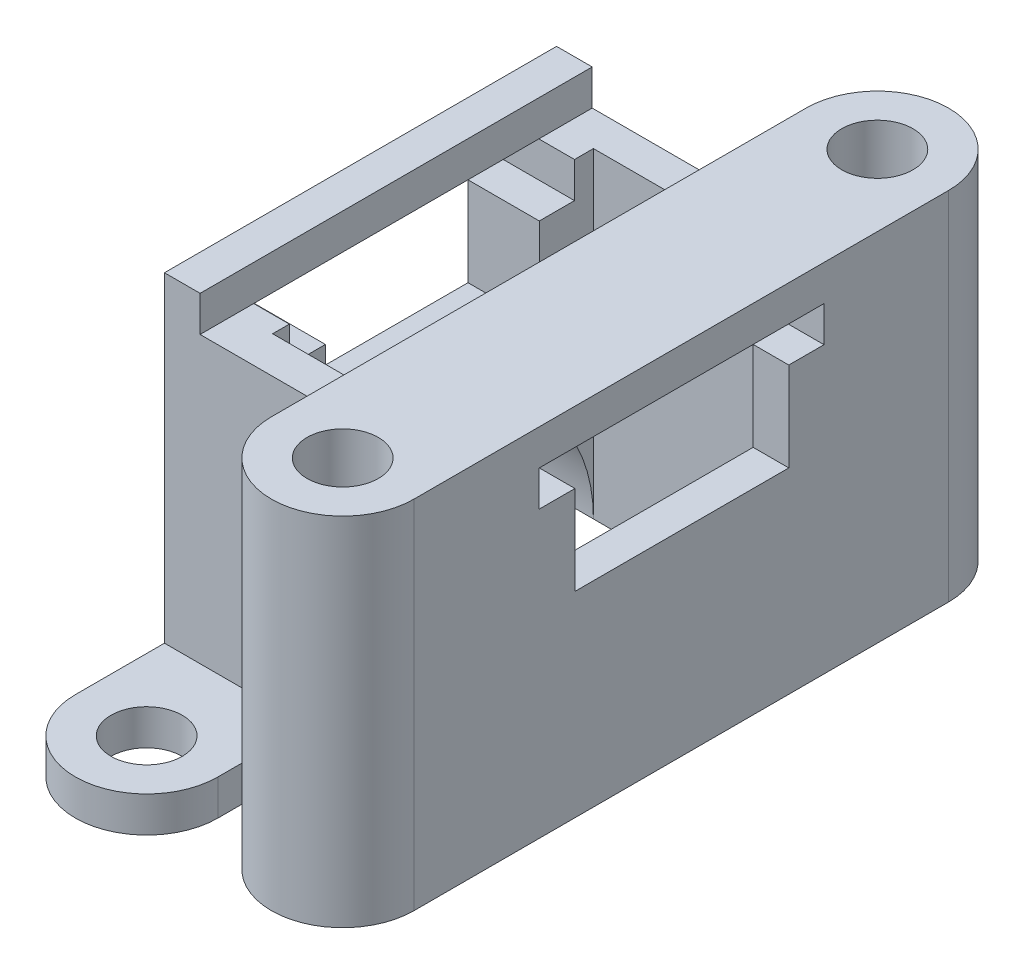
ISO-10303-21;
HEADER;
FILE_DESCRIPTION(('STEP AP214'),'2;1');
FILE_NAME('part.step','',(''),(''),'','','');
FILE_SCHEMA(('AUTOMOTIVE_DESIGN { 1 0 10303 214 1 1 1 1 }'));
ENDSEC;
DATA;
#1=APPLICATION_CONTEXT('core data for automotive mechanical design processes');
#2=APPLICATION_PROTOCOL_DEFINITION('international standard','automotive_design',2000,#1);
#3=PRODUCT_CONTEXT('',#1,'mechanical');
#4=PRODUCT('Part','Part','',(#3));
#5=PRODUCT_RELATED_PRODUCT_CATEGORY('part','',(#4));
#6=PRODUCT_DEFINITION_FORMATION('','',#4);
#7=PRODUCT_DEFINITION_CONTEXT('part definition',#1,'design');
#8=PRODUCT_DEFINITION('design','',#6,#7);
#9=PRODUCT_DEFINITION_SHAPE('','',#8);
#10=(LENGTH_UNIT() NAMED_UNIT(*) SI_UNIT(.MILLI.,.METRE.));
#11=(NAMED_UNIT(*) PLANE_ANGLE_UNIT() SI_UNIT($,.RADIAN.));
#12=(NAMED_UNIT(*) SI_UNIT($,.STERADIAN.) SOLID_ANGLE_UNIT());
#13=UNCERTAINTY_MEASURE_WITH_UNIT(LENGTH_MEASURE(1.E-05),#10,'distance_accuracy_value','');
#14=(GEOMETRIC_REPRESENTATION_CONTEXT(3) GLOBAL_UNCERTAINTY_ASSIGNED_CONTEXT((#13)) GLOBAL_UNIT_ASSIGNED_CONTEXT((#10,
#11,#12)) REPRESENTATION_CONTEXT('',''));
#15=CARTESIAN_POINT('',(0.,0.,0.));
#16=DIRECTION('',(0.,0.,1.));
#17=DIRECTION('',(1.,0.,0.));
#18=AXIS2_PLACEMENT_3D('',#15,#16,#17);
#19=CARTESIAN_POINT('',(20.8041237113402,17.,1.01982154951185));
#20=DIRECTION('',(0.,0.,1.));
#21=DIRECTION('',(1.,0.,0.));
#22=AXIS2_PLACEMENT_3D('',#19,#20,#21);
#23=PLANE('',#22);
#24=DIRECTION('',(0.,1.,0.));
#25=VECTOR('',#24,1.);
#26=CARTESIAN_POINT('',(20.8041237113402,17.,1.01982154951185));
#27=LINE('',#26,#25);
#28=CARTESIAN_POINT('',(20.8041237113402,17.,1.01982154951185));
#29=VERTEX_POINT('',#28);
#30=CARTESIAN_POINT('',(20.8041237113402,16.,1.01982154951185));
#31=VERTEX_POINT('',#30);
#32=EDGE_CURVE('E344',#29,#31,#27,.F.);
#33=ORIENTED_EDGE('',*,*,#32,.F.);
#34=DIRECTION('',(1.,0.,0.));
#35=VECTOR('',#34,1.);
#36=CARTESIAN_POINT('',(20.8041237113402,17.,1.01982154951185));
#37=LINE('',#36,#35);
#38=CARTESIAN_POINT('',(21.8041237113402,17.,1.01982154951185));
#39=VERTEX_POINT('',#38);
#40=EDGE_CURVE('E383',#39,#29,#37,.F.);
#41=ORIENTED_EDGE('',*,*,#40,.F.);
#42=DIRECTION('',(1.,0.,0.));
#43=VECTOR('',#42,1.);
#44=CARTESIAN_POINT('',(20.8041237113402,17.,1.01982154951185));
#45=LINE('',#44,#43);
#46=CARTESIAN_POINT('',(22.8041237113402,17.,1.01982154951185));
#47=VERTEX_POINT('',#46);
#48=EDGE_CURVE('E380',#47,#39,#45,.F.);
#49=ORIENTED_EDGE('',*,*,#48,.F.);
#50=DIRECTION('',(0.,1.,0.));
#51=VECTOR('',#50,1.);
#52=CARTESIAN_POINT('',(22.8041237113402,17.,1.01982154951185));
#53=LINE('',#52,#51);
#54=CARTESIAN_POINT('',(22.8041237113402,16.,1.01982154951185));
#55=VERTEX_POINT('',#54);
#56=EDGE_CURVE('E384',#55,#47,#53,.T.);
#57=ORIENTED_EDGE('',*,*,#56,.F.);
#58=DIRECTION('',(1.,0.,0.));
#59=VECTOR('',#58,1.);
#60=CARTESIAN_POINT('',(20.8041237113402,16.,1.01982154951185));
#61=LINE('',#60,#59);
#62=EDGE_CURVE('E332',#55,#31,#61,.F.);
#63=ORIENTED_EDGE('',*,*,#62,.T.);
#64=EDGE_LOOP('',(#33,#41,#49,#57,#63));
#65=FACE_BOUND('',#64,.T.);
#66=ADVANCED_FACE('F17',(#65),#23,.F.);
#67=CARTESIAN_POINT('',(20.8041237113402,17.,-6.98017845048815));
#68=DIRECTION('',(0.,0.,-1.));
#69=DIRECTION('',(-1.,0.,0.));
#70=AXIS2_PLACEMENT_3D('',#67,#68,#69);
#71=PLANE('',#70);
#72=DIRECTION('',(0.,1.,0.));
#73=VECTOR('',#72,1.);
#74=CARTESIAN_POINT('',(20.8041237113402,17.,-6.98017845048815));
#75=LINE('',#74,#73);
#76=CARTESIAN_POINT('',(20.8041237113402,16.,-6.98017845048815));
#77=VERTEX_POINT('',#76);
#78=CARTESIAN_POINT('',(20.8041237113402,17.,-6.98017845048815));
#79=VERTEX_POINT('',#78);
#80=EDGE_CURVE('E350',#77,#79,#75,.T.);
#81=ORIENTED_EDGE('',*,*,#80,.F.);
#82=DIRECTION('',(1.,0.,0.));
#83=VECTOR('',#82,1.);
#84=CARTESIAN_POINT('',(20.8041237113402,16.,-6.98017845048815));
#85=LINE('',#84,#83);
#86=CARTESIAN_POINT('',(22.8041237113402,16.,-6.98017845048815));
#87=VERTEX_POINT('',#86);
#88=EDGE_CURVE('E323',#77,#87,#85,.T.);
#89=ORIENTED_EDGE('',*,*,#88,.T.);
#90=DIRECTION('',(0.,1.,0.));
#91=VECTOR('',#90,1.);
#92=CARTESIAN_POINT('',(22.8041237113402,17.,-6.98017845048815));
#93=LINE('',#92,#91);
#94=CARTESIAN_POINT('',(22.8041237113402,17.,-6.98017845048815));
#95=VERTEX_POINT('',#94);
#96=EDGE_CURVE('E343',#95,#87,#93,.F.);
#97=ORIENTED_EDGE('',*,*,#96,.F.);
#98=DIRECTION('',(-1.,0.,0.));
#99=VECTOR('',#98,1.);
#100=CARTESIAN_POINT('',(20.8041237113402,17.,-6.98017845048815));
#101=LINE('',#100,#99);
#102=CARTESIAN_POINT('',(21.8041237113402,17.,-6.98017845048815));
#103=VERTEX_POINT('',#102);
#104=EDGE_CURVE('E340',#103,#95,#101,.F.);
#105=ORIENTED_EDGE('',*,*,#104,.F.);
#106=DIRECTION('',(-1.,0.,0.));
#107=VECTOR('',#106,1.);
#108=CARTESIAN_POINT('',(20.8041237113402,17.,-6.98017845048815));
#109=LINE('',#108,#107);
#110=EDGE_CURVE('E347',#79,#103,#109,.F.);
#111=ORIENTED_EDGE('',*,*,#110,.F.);
#112=EDGE_LOOP('',(#81,#89,#97,#105,#111));
#113=FACE_BOUND('',#112,.T.);
#114=ADVANCED_FACE('F933',(#113),#71,.F.);
#115=CARTESIAN_POINT('',(20.8041237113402,16.,1.01982154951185));
#116=DIRECTION('',(0.,-1.,0.));
#117=DIRECTION('',(0.,0.,-1.));
#118=AXIS2_PLACEMENT_3D('',#115,#116,#117);
#119=PLANE('',#118);
#120=DIRECTION('',(0.,0.,-1.));
#121=VECTOR('',#120,1.);
#122=CARTESIAN_POINT('',(20.8041237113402,16.,1.01982154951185));
#123=LINE('',#122,#121);
#124=CARTESIAN_POINT('',(20.8041237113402,16.,0.00780346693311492));
#125=VERTEX_POINT('',#124);
#126=EDGE_CURVE('E329',#31,#125,#123,.T.);
#127=ORIENTED_EDGE('',*,*,#126,.F.);
#128=ORIENTED_EDGE('',*,*,#62,.F.);
#129=DIRECTION('',(0.,0.,1.));
#130=VECTOR('',#129,1.);
#131=CARTESIAN_POINT('',(22.8041237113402,16.,1.48891790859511));
#132=LINE('',#131,#130);
#133=CARTESIAN_POINT('',(22.8041237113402,16.,0.00780346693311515));
#134=VERTEX_POINT('',#133);
#135=EDGE_CURVE('E402',#55,#134,#132,.F.);
#136=ORIENTED_EDGE('',*,*,#135,.T.);
#137=DIRECTION('',(1.,0.,0.));
#138=VECTOR('',#137,1.);
#139=CARTESIAN_POINT('',(20.8041237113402,16.,0.00780346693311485));
#140=LINE('',#139,#138);
#141=EDGE_CURVE('E531',#134,#125,#140,.F.);
#142=ORIENTED_EDGE('',*,*,#141,.T.);
#143=EDGE_LOOP('',(#127,#128,#136,#142));
#144=FACE_BOUND('',#143,.T.);
#145=ADVANCED_FACE('F930',(#144),#119,.F.);
#146=CARTESIAN_POINT('',(20.8041237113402,16.,-5.99219653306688));
#147=DIRECTION('',(0.,-1.,0.));
#148=DIRECTION('',(0.,0.,-1.));
#149=AXIS2_PLACEMENT_3D('',#146,#147,#148);
#150=PLANE('',#149);
#151=DIRECTION('',(0.,0.,-1.));
#152=VECTOR('',#151,1.);
#153=CARTESIAN_POINT('',(20.8041237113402,16.,-5.99219653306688));
#154=LINE('',#153,#152);
#155=CARTESIAN_POINT('',(20.8041237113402,16.,-5.99219653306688));
#156=VERTEX_POINT('',#155);
#157=EDGE_CURVE('E331',#156,#77,#154,.T.);
#158=ORIENTED_EDGE('',*,*,#157,.F.);
#159=DIRECTION('',(-1.,0.,0.));
#160=VECTOR('',#159,1.);
#161=CARTESIAN_POINT('',(20.8041237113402,16.,-5.99219653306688));
#162=LINE('',#161,#160);
#163=CARTESIAN_POINT('',(22.8041237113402,16.,-5.99219653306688));
#164=VERTEX_POINT('',#163);
#165=EDGE_CURVE('E337',#156,#164,#162,.F.);
#166=ORIENTED_EDGE('',*,*,#165,.T.);
#167=DIRECTION('',(0.,0.,1.));
#168=VECTOR('',#167,1.);
#169=CARTESIAN_POINT('',(22.8041237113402,16.,1.48891790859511));
#170=LINE('',#169,#168);
#171=EDGE_CURVE('E316',#164,#87,#170,.F.);
#172=ORIENTED_EDGE('',*,*,#171,.T.);
#173=ORIENTED_EDGE('',*,*,#88,.F.);
#174=EDGE_LOOP('',(#158,#166,#172,#173));
#175=FACE_BOUND('',#174,.T.);
#176=ADVANCED_FACE('F927',(#175),#150,.F.);
#177=CARTESIAN_POINT('',(21.8041237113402,17.,2.5232552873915));
#178=DIRECTION('',(-1.,0.,0.));
#179=DIRECTION('',(0.,0.,1.));
#180=AXIS2_PLACEMENT_3D('',#177,#178,#179);
#181=PLANE('',#180);
#182=DIRECTION('',(0.,1.,0.));
#183=VECTOR('',#182,1.);
#184=CARTESIAN_POINT('',(21.8041237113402,18.,2.5232552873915));
#185=LINE('',#184,#183);
#186=CARTESIAN_POINT('',(21.8041237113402,18.,2.5232552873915));
#187=VERTEX_POINT('',#186);
#188=CARTESIAN_POINT('',(21.8041237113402,17.,2.5232552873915));
#189=VERTEX_POINT('',#188);
#190=EDGE_CURVE('E283',#187,#189,#185,.F.);
#191=ORIENTED_EDGE('',*,*,#190,.T.);
#192=DIRECTION('',(0.,0.,-1.));
#193=VECTOR('',#192,1.);
#194=CARTESIAN_POINT('',(21.8041237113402,17.,0.));
#195=LINE('',#194,#193);
#196=EDGE_CURVE('E317',#189,#39,#195,.T.);
#197=ORIENTED_EDGE('',*,*,#196,.T.);
#198=DIRECTION('',(0.,0.,1.));
#199=VECTOR('',#198,1.);
#200=CARTESIAN_POINT('',(21.8041237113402,17.,0.));
#201=LINE('',#200,#199);
#202=EDGE_CURVE('E333',#39,#103,#201,.F.);
#203=ORIENTED_EDGE('',*,*,#202,.T.);
#204=DIRECTION('',(0.,0.,-1.));
#205=VECTOR('',#204,1.);
#206=CARTESIAN_POINT('',(21.8041237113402,17.,0.));
#207=LINE('',#206,#205);
#208=CARTESIAN_POINT('',(21.8041237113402,17.,-8.47674471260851));
#209=VERTEX_POINT('',#208);
#210=EDGE_CURVE('E314',#103,#209,#207,.T.);
#211=ORIENTED_EDGE('',*,*,#210,.T.);
#212=DIRECTION('',(0.,1.,0.));
#213=VECTOR('',#212,1.);
#214=CARTESIAN_POINT('',(21.8041237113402,17.,-8.47674471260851));
#215=LINE('',#214,#213);
#216=CARTESIAN_POINT('',(21.8041237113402,18.,-8.47674471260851));
#217=VERTEX_POINT('',#216);
#218=EDGE_CURVE('E305',#217,#209,#215,.F.);
#219=ORIENTED_EDGE('',*,*,#218,.F.);
#220=DIRECTION('',(0.,0.,-1.));
#221=VECTOR('',#220,1.);
#222=CARTESIAN_POINT('',(21.8041237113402,18.,4.52325528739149));
#223=LINE('',#222,#221);
#224=EDGE_CURVE('E298',#217,#187,#223,.F.);
#225=ORIENTED_EDGE('',*,*,#224,.T.);
#226=EDGE_LOOP('',(#191,#197,#203,#211,#219,#225));
#227=FACE_BOUND('',#226,.T.);
#228=ADVANCED_FACE('F303',(#227),#181,.F.);
#229=CARTESIAN_POINT('',(0.,17.,0.));
#230=DIRECTION('',(0.,-1.,0.));
#231=DIRECTION('',(0.,0.,-1.));
#232=AXIS2_PLACEMENT_3D('',#229,#230,#231);
#233=PLANE('',#232);
#234=ORIENTED_EDGE('',*,*,#48,.T.);
#235=ORIENTED_EDGE('',*,*,#196,.F.);
#236=DIRECTION('',(-1.,0.,0.));
#237=VECTOR('',#236,1.);
#238=CARTESIAN_POINT('',(25.8041237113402,17.,2.5232552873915));
#239=LINE('',#238,#237);
#240=CARTESIAN_POINT('',(25.8041237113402,17.,2.5232552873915));
#241=VERTEX_POINT('',#240);
#242=EDGE_CURVE('E289',#189,#241,#239,.F.);
#243=ORIENTED_EDGE('',*,*,#242,.T.);
#244=DIRECTION('',(0.,0.,-1.));
#245=VECTOR('',#244,1.);
#246=CARTESIAN_POINT('',(25.8041237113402,17.,-8.47674471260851));
#247=LINE('',#246,#245);
#248=CARTESIAN_POINT('',(25.8041237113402,17.,1.48891790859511));
#249=VERTEX_POINT('',#248);
#250=EDGE_CURVE('E467',#241,#249,#247,.T.);
#251=ORIENTED_EDGE('',*,*,#250,.T.);
#252=DIRECTION('',(1.,0.,0.));
#253=VECTOR('',#252,1.);
#254=CARTESIAN_POINT('',(28.8041237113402,17.,1.48891790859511));
#255=LINE('',#254,#253);
#256=CARTESIAN_POINT('',(22.8041237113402,17.,1.48891790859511));
#257=VERTEX_POINT('',#256);
#258=EDGE_CURVE('E460',#249,#257,#255,.F.);
#259=ORIENTED_EDGE('',*,*,#258,.T.);
#260=DIRECTION('',(0.,0.,1.));
#261=VECTOR('',#260,1.);
#262=CARTESIAN_POINT('',(22.8041237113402,17.,1.48891790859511));
#263=LINE('',#262,#261);
#264=EDGE_CURVE('E405',#257,#47,#263,.F.);
#265=ORIENTED_EDGE('',*,*,#264,.T.);
#266=EDGE_LOOP('',(#234,#235,#243,#251,#259,#265));
#267=FACE_BOUND('',#266,.T.);
#268=ADVANCED_FACE('F920',(#267),#233,.F.);
#269=CARTESIAN_POINT('',(0.,17.,0.));
#270=DIRECTION('',(0.,-1.,0.));
#271=DIRECTION('',(0.,0.,-1.));
#272=AXIS2_PLACEMENT_3D('',#269,#270,#271);
#273=PLANE('',#272);
#274=DIRECTION('',(1.,0.,0.));
#275=VECTOR('',#274,1.);
#276=CARTESIAN_POINT('',(24.8041237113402,17.,-8.47674471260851));
#277=LINE('',#276,#275);
#278=CARTESIAN_POINT('',(25.8041237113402,17.,-8.47674471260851));
#279=VERTEX_POINT('',#278);
#280=EDGE_CURVE('E481',#279,#209,#277,.F.);
#281=ORIENTED_EDGE('',*,*,#280,.T.);
#282=ORIENTED_EDGE('',*,*,#210,.F.);
#283=ORIENTED_EDGE('',*,*,#104,.T.);
#284=DIRECTION('',(0.,0.,1.));
#285=VECTOR('',#284,1.);
#286=CARTESIAN_POINT('',(22.8041237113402,17.,1.48891790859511));
#287=LINE('',#286,#285);
#288=CARTESIAN_POINT('',(22.8041237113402,17.,-7.51108209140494));
#289=VERTEX_POINT('',#288);
#290=EDGE_CURVE('E377',#95,#289,#287,.F.);
#291=ORIENTED_EDGE('',*,*,#290,.T.);
#292=DIRECTION('',(-1.,0.,0.));
#293=VECTOR('',#292,1.);
#294=CARTESIAN_POINT('',(28.8041237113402,17.,-7.51108209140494));
#295=LINE('',#294,#293);
#296=CARTESIAN_POINT('',(25.8041237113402,17.,-7.51108209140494));
#297=VERTEX_POINT('',#296);
#298=EDGE_CURVE('E540',#289,#297,#295,.F.);
#299=ORIENTED_EDGE('',*,*,#298,.T.);
#300=DIRECTION('',(0.,0.,-1.));
#301=VECTOR('',#300,1.);
#302=CARTESIAN_POINT('',(25.8041237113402,17.,-8.47674471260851));
#303=LINE('',#302,#301);
#304=EDGE_CURVE('E564',#297,#279,#303,.T.);
#305=ORIENTED_EDGE('',*,*,#304,.T.);
#306=EDGE_LOOP('',(#281,#282,#283,#291,#299,#305));
#307=FACE_BOUND('',#306,.T.);
#308=ADVANCED_FACE('F916',(#307),#273,.F.);
#309=CARTESIAN_POINT('',(22.8041237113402,17.,1.48891790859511));
#310=DIRECTION('',(-1.,0.,0.));
#311=DIRECTION('',(0.,0.,1.));
#312=AXIS2_PLACEMENT_3D('',#309,#310,#311);
#313=PLANE('',#312);
#314=ORIENTED_EDGE('',*,*,#56,.T.);
#315=ORIENTED_EDGE('',*,*,#264,.F.);
#316=DIRECTION('',(0.,1.,0.));
#317=VECTOR('',#316,1.);
#318=CARTESIAN_POINT('',(22.8041237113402,17.,1.48891790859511));
#319=LINE('',#318,#317);
#320=CARTESIAN_POINT('',(22.8041237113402,8.,1.48891790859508));
#321=VERTEX_POINT('',#320);
#322=EDGE_CURVE('E587',#257,#321,#319,.F.);
#323=ORIENTED_EDGE('',*,*,#322,.T.);
#324=CARTESIAN_POINT('',(22.8041237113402,8.,-3.01108209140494));
#325=DIRECTION('',(1.,0.,0.));
#326=DIRECTION('',(0.,0.,-1.));
#327=AXIS2_PLACEMENT_3D('',#324,#325,#326);
#328=CIRCLE('',#327,4.5);
#329=CARTESIAN_POINT('',(22.8041237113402,8.,-7.51108209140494));
#330=VERTEX_POINT('',#329);
#331=EDGE_CURVE('E453',#321,#330,#328,.F.);
#332=ORIENTED_EDGE('',*,*,#331,.T.);
#333=DIRECTION('',(0.,1.,0.));
#334=VECTOR('',#333,1.);
#335=CARTESIAN_POINT('',(22.8041237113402,17.,-7.51108209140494));
#336=LINE('',#335,#334);
#337=EDGE_CURVE('E457',#330,#289,#336,.T.);
#338=ORIENTED_EDGE('',*,*,#337,.T.);
#339=ORIENTED_EDGE('',*,*,#290,.F.);
#340=ORIENTED_EDGE('',*,*,#96,.T.);
#341=ORIENTED_EDGE('',*,*,#171,.F.);
#342=DIRECTION('',(0.,1.,0.));
#343=VECTOR('',#342,1.);
#344=CARTESIAN_POINT('',(22.8041237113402,16.,-5.99219653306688));
#345=LINE('',#344,#343);
#346=CARTESIAN_POINT('',(22.8041237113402,13.5,-5.99219653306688));
#347=VERTEX_POINT('',#346);
#348=EDGE_CURVE('E522',#164,#347,#345,.F.);
#349=ORIENTED_EDGE('',*,*,#348,.T.);
#350=DIRECTION('',(0.,0.,-1.));
#351=VECTOR('',#350,1.);
#352=CARTESIAN_POINT('',(22.8041237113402,13.5,0.00780346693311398));
#353=LINE('',#352,#351);
#354=CARTESIAN_POINT('',(22.8041237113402,13.5,0.00780346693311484));
#355=VERTEX_POINT('',#354);
#356=EDGE_CURVE('E528',#347,#355,#353,.F.);
#357=ORIENTED_EDGE('',*,*,#356,.T.);
#358=DIRECTION('',(0.,-1.,0.));
#359=VECTOR('',#358,1.);
#360=CARTESIAN_POINT('',(22.8041237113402,16.,0.00780346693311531));
#361=LINE('',#360,#359);
#362=EDGE_CURVE('E404',#355,#134,#361,.F.);
#363=ORIENTED_EDGE('',*,*,#362,.T.);
#364=ORIENTED_EDGE('',*,*,#135,.F.);
#365=EDGE_LOOP('',(#314,#315,#323,#332,#338,#339,#340,#341,#349,#357,#363,#364));
#366=FACE_BOUND('',#365,.T.);
#367=ADVANCED_FACE('F912',(#366),#313,.F.);
#368=CARTESIAN_POINT('',(20.8041237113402,16.,0.00780346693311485));
#369=DIRECTION('',(0.,0.,1.));
#370=DIRECTION('',(0.,-1.,0.));
#371=AXIS2_PLACEMENT_3D('',#368,#369,#370);
#372=PLANE('',#371);
#373=DIRECTION('',(0.,1.,0.));
#374=VECTOR('',#373,1.);
#375=CARTESIAN_POINT('',(20.8041237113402,8.,0.00780346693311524));
#376=LINE('',#375,#374);
#377=CARTESIAN_POINT('',(20.8041237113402,13.5,0.00780346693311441));
#378=VERTEX_POINT('',#377);
#379=EDGE_CURVE('E456',#125,#378,#376,.F.);
#380=ORIENTED_EDGE('',*,*,#379,.F.);
#381=ORIENTED_EDGE('',*,*,#141,.F.);
#382=ORIENTED_EDGE('',*,*,#362,.F.);
#383=DIRECTION('',(1.,0.,0.));
#384=VECTOR('',#383,1.);
#385=CARTESIAN_POINT('',(20.8041237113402,13.5,0.00780346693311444));
#386=LINE('',#385,#384);
#387=EDGE_CURVE('E525',#355,#378,#386,.F.);
#388=ORIENTED_EDGE('',*,*,#387,.T.);
#389=EDGE_LOOP('',(#380,#381,#382,#388));
#390=FACE_BOUND('',#389,.T.);
#391=ADVANCED_FACE('F908',(#390),#372,.F.);
#392=CARTESIAN_POINT('',(20.8041237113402,13.5,0.00780346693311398));
#393=DIRECTION('',(0.,-1.,0.));
#394=DIRECTION('',(0.,0.,-1.));
#395=AXIS2_PLACEMENT_3D('',#392,#393,#394);
#396=PLANE('',#395);
#397=DIRECTION('',(0.,0.,1.));
#398=VECTOR('',#397,1.);
#399=CARTESIAN_POINT('',(20.8041237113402,13.5,5.02325528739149));
#400=LINE('',#399,#398);
#401=CARTESIAN_POINT('',(20.8041237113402,13.5,-5.99219653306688));
#402=VERTEX_POINT('',#401);
#403=EDGE_CURVE('E704',#378,#402,#400,.F.);
#404=ORIENTED_EDGE('',*,*,#403,.F.);
#405=ORIENTED_EDGE('',*,*,#387,.F.);
#406=ORIENTED_EDGE('',*,*,#356,.F.);
#407=DIRECTION('',(-1.,0.,0.));
#408=VECTOR('',#407,1.);
#409=CARTESIAN_POINT('',(20.8041237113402,13.5,-5.99219653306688));
#410=LINE('',#409,#408);
#411=EDGE_CURVE('E519',#347,#402,#410,.T.);
#412=ORIENTED_EDGE('',*,*,#411,.T.);
#413=EDGE_LOOP('',(#404,#405,#406,#412));
#414=FACE_BOUND('',#413,.T.);
#415=ADVANCED_FACE('F904',(#414),#396,.F.);
#416=CARTESIAN_POINT('',(20.8041237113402,16.,-5.99219653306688));
#417=DIRECTION('',(0.,0.,-1.));
#418=DIRECTION('',(-1.,0.,0.));
#419=AXIS2_PLACEMENT_3D('',#416,#417,#418);
#420=PLANE('',#419);
#421=DIRECTION('',(0.,1.,0.));
#422=VECTOR('',#421,1.);
#423=CARTESIAN_POINT('',(20.8041237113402,8.,-5.99219653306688));
#424=LINE('',#423,#422);
#425=EDGE_CURVE('E357',#402,#156,#424,.T.);
#426=ORIENTED_EDGE('',*,*,#425,.F.);
#427=ORIENTED_EDGE('',*,*,#411,.F.);
#428=ORIENTED_EDGE('',*,*,#348,.F.);
#429=ORIENTED_EDGE('',*,*,#165,.F.);
#430=EDGE_LOOP('',(#426,#427,#428,#429));
#431=FACE_BOUND('',#430,.T.);
#432=ADVANCED_FACE('F900',(#431),#420,.F.);
#433=CARTESIAN_POINT('',(0.,17.,0.));
#434=DIRECTION('',(0.,1.,0.));
#435=DIRECTION('',(0.,0.,1.));
#436=AXIS2_PLACEMENT_3D('',#433,#434,#435);
#437=PLANE('',#436);
#438=ORIENTED_EDGE('',*,*,#202,.F.);
#439=ORIENTED_EDGE('',*,*,#40,.T.);
#440=DIRECTION('',(0.,0.,1.));
#441=VECTOR('',#440,1.);
#442=CARTESIAN_POINT('',(20.8041237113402,17.,5.02325528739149));
#443=LINE('',#442,#441);
#444=EDGE_CURVE('E353',#79,#29,#443,.T.);
#445=ORIENTED_EDGE('',*,*,#444,.F.);
#446=ORIENTED_EDGE('',*,*,#110,.T.);
#447=EDGE_LOOP('',(#438,#439,#445,#446));
#448=FACE_BOUND('',#447,.T.);
#449=ADVANCED_FACE('F896',(#448),#437,.F.);
#450=CARTESIAN_POINT('',(0.,9.00000000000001,0.));
#451=DIRECTION('',(0.,-1.,0.));
#452=DIRECTION('',(0.,0.,-1.));
#453=AXIS2_PLACEMENT_3D('',#450,#451,#452);
#454=PLANE('',#453);
#455=DIRECTION('',(0.,0.,-1.));
#456=VECTOR('',#455,1.);
#457=CARTESIAN_POINT('',(24.8041237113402,9.00000000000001,3.8182677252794));
#458=LINE('',#457,#456);
#459=CARTESIAN_POINT('',(24.8041237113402,9.00000000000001,2.5232552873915));
#460=VERTEX_POINT('',#459);
#461=CARTESIAN_POINT('',(24.8041237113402,9.00000000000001,5.02325528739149));
#462=VERTEX_POINT('',#461);
#463=EDGE_CURVE('E88',#460,#462,#458,.F.);
#464=ORIENTED_EDGE('',*,*,#463,.F.);
#465=DIRECTION('',(-1.,0.,0.));
#466=VECTOR('',#465,1.);
#467=CARTESIAN_POINT('',(25.8041237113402,9.00000000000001,2.5232552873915));
#468=LINE('',#467,#466);
#469=CARTESIAN_POINT('',(20.8041237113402,9.00000000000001,2.5232552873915));
#470=VERTEX_POINT('',#469);
#471=EDGE_CURVE('E100',#460,#470,#468,.T.);
#472=ORIENTED_EDGE('',*,*,#471,.T.);
#473=DIRECTION('',(0.,0.,1.));
#474=VECTOR('',#473,1.);
#475=CARTESIAN_POINT('',(20.8041237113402,9.00000000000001,5.02325528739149));
#476=LINE('',#475,#474);
#477=CARTESIAN_POINT('',(20.8041237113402,9.00000000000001,5.02325528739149));
#478=VERTEX_POINT('',#477);
#479=EDGE_CURVE('E507',#478,#470,#476,.F.);
#480=ORIENTED_EDGE('',*,*,#479,.F.);
#481=CARTESIAN_POINT('',(22.8041237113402,9.00000000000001,5.02325528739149));
#482=DIRECTION('',(0.,-1.,0.));
#483=DIRECTION('',(0.,0.,-1.));
#484=AXIS2_PLACEMENT_3D('',#481,#482,#483);
#485=CIRCLE('',#484,2.00000000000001);
#486=EDGE_CURVE('E458',#462,#478,#485,.T.);
#487=ORIENTED_EDGE('',*,*,#486,.F.);
#488=EDGE_LOOP('',(#464,#472,#480,#487));
#489=FACE_BOUND('',#488,.T.);
#490=CARTESIAN_POINT('',(22.8041237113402,9.00000000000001,5.02325528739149));
#491=DIRECTION('',(0.,1.,0.));
#492=DIRECTION('',(0.,0.,1.));
#493=AXIS2_PLACEMENT_3D('',#490,#491,#492);
#494=CIRCLE('',#493,1.);
#495=CARTESIAN_POINT('',(22.8041237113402,9.00000000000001,6.02325528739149));
#496=VERTEX_POINT('',#495);
#497=EDGE_CURVE('E20',#496,#496,#494,.F.);
#498=ORIENTED_EDGE('',*,*,#497,.T.);
#499=EDGE_LOOP('',(#498));
#500=FACE_BOUND('',#499,.T.);
#501=ADVANCED_FACE('F893',(#489,#500),#454,.F.);
#502=CARTESIAN_POINT('',(25.8041237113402,18.,2.5232552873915));
#503=DIRECTION('',(0.,0.,-1.));
#504=DIRECTION('',(-1.,0.,0.));
#505=AXIS2_PLACEMENT_3D('',#502,#503,#504);
#506=PLANE('',#505);
#507=ORIENTED_EDGE('',*,*,#190,.F.);
#508=DIRECTION('',(1.,0.,0.));
#509=VECTOR('',#508,1.);
#510=CARTESIAN_POINT('',(27.8041237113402,18.,2.5232552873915));
#511=LINE('',#510,#509);
#512=CARTESIAN_POINT('',(20.8041237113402,18.,2.5232552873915));
#513=VERTEX_POINT('',#512);
#514=EDGE_CURVE('E286',#187,#513,#511,.F.);
#515=ORIENTED_EDGE('',*,*,#514,.T.);
#516=DIRECTION('',(0.,1.,0.));
#517=VECTOR('',#516,1.);
#518=CARTESIAN_POINT('',(20.8041237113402,8.,2.5232552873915));
#519=LINE('',#518,#517);
#520=EDGE_CURVE('E501',#470,#513,#519,.T.);
#521=ORIENTED_EDGE('',*,*,#520,.F.);
#522=ORIENTED_EDGE('',*,*,#471,.F.);
#523=DIRECTION('',(0.,1.,0.));
#524=VECTOR('',#523,1.);
#525=CARTESIAN_POINT('',(24.8041237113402,8.,2.5232552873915));
#526=LINE('',#525,#524);
#527=CARTESIAN_POINT('',(24.8041237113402,8.,2.5232552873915));
#528=VERTEX_POINT('',#527);
#529=EDGE_CURVE('E595',#528,#460,#526,.T.);
#530=ORIENTED_EDGE('',*,*,#529,.F.);
#531=DIRECTION('',(-1.,0.,0.));
#532=VECTOR('',#531,1.);
#533=CARTESIAN_POINT('',(25.8041237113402,8.,2.5232552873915));
#534=LINE('',#533,#532);
#535=CARTESIAN_POINT('',(25.8041237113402,8.,2.5232552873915));
#536=VERTEX_POINT('',#535);
#537=EDGE_CURVE('E336',#536,#528,#534,.T.);
#538=ORIENTED_EDGE('',*,*,#537,.F.);
#539=DIRECTION('',(0.,1.,0.));
#540=VECTOR('',#539,1.);
#541=CARTESIAN_POINT('',(25.8041237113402,18.,2.5232552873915));
#542=LINE('',#541,#540);
#543=EDGE_CURVE('E464',#536,#241,#542,.T.);
#544=ORIENTED_EDGE('',*,*,#543,.T.);
#545=ORIENTED_EDGE('',*,*,#242,.F.);
#546=EDGE_LOOP('',(#507,#515,#521,#522,#530,#538,#544,#545));
#547=FACE_BOUND('',#546,.T.);
#548=ADVANCED_FACE('F285',(#547),#506,.F.);
#549=CARTESIAN_POINT('',(27.8041237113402,18.,4.52325528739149));
#550=DIRECTION('',(0.,-1.,0.));
#551=DIRECTION('',(0.,0.,-1.));
#552=AXIS2_PLACEMENT_3D('',#549,#550,#551);
#553=PLANE('',#552);
#554=ORIENTED_EDGE('',*,*,#224,.F.);
#555=DIRECTION('',(1.,0.,0.));
#556=VECTOR('',#555,1.);
#557=CARTESIAN_POINT('',(24.8041237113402,18.,-8.47674471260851));
#558=LINE('',#557,#556);
#559=CARTESIAN_POINT('',(20.8041237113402,18.,-8.47674471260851));
#560=VERTEX_POINT('',#559);
#561=EDGE_CURVE('E474',#217,#560,#558,.F.);
#562=ORIENTED_EDGE('',*,*,#561,.T.);
#563=DIRECTION('',(0.,0.,1.));
#564=VECTOR('',#563,1.);
#565=CARTESIAN_POINT('',(20.8041237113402,18.,5.02325528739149));
#566=LINE('',#565,#564);
#567=EDGE_CURVE('E300',#513,#560,#566,.F.);
#568=ORIENTED_EDGE('',*,*,#567,.F.);
#569=ORIENTED_EDGE('',*,*,#514,.F.);
#570=EDGE_LOOP('',(#554,#562,#568,#569));
#571=FACE_BOUND('',#570,.T.);
#572=ADVANCED_FACE('F296',(#571),#553,.F.);
#573=CARTESIAN_POINT('',(24.8041237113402,18.,-8.47674471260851));
#574=DIRECTION('',(0.,0.,1.));
#575=DIRECTION('',(1.,0.,0.));
#576=AXIS2_PLACEMENT_3D('',#573,#574,#575);
#577=PLANE('',#576);
#578=ORIENTED_EDGE('',*,*,#218,.T.);
#579=ORIENTED_EDGE('',*,*,#280,.F.);
#580=DIRECTION('',(0.,1.,0.));
#581=VECTOR('',#580,1.);
#582=CARTESIAN_POINT('',(25.8041237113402,18.,-8.47674471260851));
#583=LINE('',#582,#581);
#584=CARTESIAN_POINT('',(25.8041237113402,8.,-8.47674471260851));
#585=VERTEX_POINT('',#584);
#586=EDGE_CURVE('E567',#279,#585,#583,.F.);
#587=ORIENTED_EDGE('',*,*,#586,.T.);
#588=DIRECTION('',(1.,0.,0.));
#589=VECTOR('',#588,1.);
#590=CARTESIAN_POINT('',(24.8041237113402,8.,-8.47674471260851));
#591=LINE('',#590,#589);
#592=CARTESIAN_POINT('',(24.8041237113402,8.,-8.47674471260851));
#593=VERTEX_POINT('',#592);
#594=EDGE_CURVE('E601',#593,#585,#591,.T.);
#595=ORIENTED_EDGE('',*,*,#594,.F.);
#596=DIRECTION('',(0.,1.,0.));
#597=VECTOR('',#596,1.);
#598=CARTESIAN_POINT('',(24.8041237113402,18.,-8.47674471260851));
#599=LINE('',#598,#597);
#600=CARTESIAN_POINT('',(24.8041237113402,9.00000000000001,-8.47674471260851));
#601=VERTEX_POINT('',#600);
#602=EDGE_CURVE('E301',#601,#593,#599,.F.);
#603=ORIENTED_EDGE('',*,*,#602,.F.);
#604=DIRECTION('',(1.,0.,0.));
#605=VECTOR('',#604,1.);
#606=CARTESIAN_POINT('',(0.,9.00000000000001,-8.47674471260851));
#607=LINE('',#606,#605);
#608=CARTESIAN_POINT('',(20.8041237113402,9.00000000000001,-8.47674471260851));
#609=VERTEX_POINT('',#608);
#610=EDGE_CURVE('E470',#609,#601,#607,.T.);
#611=ORIENTED_EDGE('',*,*,#610,.F.);
#612=DIRECTION('',(0.,1.,0.));
#613=VECTOR('',#612,1.);
#614=CARTESIAN_POINT('',(20.8041237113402,8.,-8.47674471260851));
#615=LINE('',#614,#613);
#616=EDGE_CURVE('E492',#560,#609,#615,.F.);
#617=ORIENTED_EDGE('',*,*,#616,.F.);
#618=ORIENTED_EDGE('',*,*,#561,.F.);
#619=EDGE_LOOP('',(#578,#579,#587,#595,#603,#611,#617,#618));
#620=FACE_BOUND('',#619,.T.);
#621=ADVANCED_FACE('F618',(#620),#577,.F.);
#622=CARTESIAN_POINT('',(0.,9.00000000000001,0.));
#623=DIRECTION('',(0.,1.,0.));
#624=DIRECTION('',(0.,0.,1.));
#625=AXIS2_PLACEMENT_3D('',#622,#623,#624);
#626=PLANE('',#625);
#627=DIRECTION('',(0.,0.,-1.));
#628=VECTOR('',#627,1.);
#629=CARTESIAN_POINT('',(24.8041237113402,9.00000000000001,3.8182677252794));
#630=LINE('',#629,#628);
#631=CARTESIAN_POINT('',(24.8041237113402,9.00000000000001,-10.9767447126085));
#632=VERTEX_POINT('',#631);
#633=EDGE_CURVE('E616',#632,#601,#630,.F.);
#634=ORIENTED_EDGE('',*,*,#633,.F.);
#635=CARTESIAN_POINT('',(22.8041237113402,9.00000000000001,-10.9767447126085));
#636=DIRECTION('',(0.,-1.,0.));
#637=DIRECTION('',(0.,0.,-1.));
#638=AXIS2_PLACEMENT_3D('',#635,#636,#637);
#639=CIRCLE('',#638,2.);
#640=CARTESIAN_POINT('',(20.8041237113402,9.00000000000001,-10.9767447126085));
#641=VERTEX_POINT('',#640);
#642=EDGE_CURVE('E447',#641,#632,#639,.T.);
#643=ORIENTED_EDGE('',*,*,#642,.F.);
#644=DIRECTION('',(0.,0.,1.));
#645=VECTOR('',#644,1.);
#646=CARTESIAN_POINT('',(20.8041237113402,9.00000000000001,5.02325528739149));
#647=LINE('',#646,#645);
#648=EDGE_CURVE('E489',#609,#641,#647,.F.);
#649=ORIENTED_EDGE('',*,*,#648,.F.);
#650=ORIENTED_EDGE('',*,*,#610,.T.);
#651=EDGE_LOOP('',(#634,#643,#649,#650));
#652=FACE_BOUND('',#651,.T.);
#653=CARTESIAN_POINT('',(22.8041237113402,9.00000000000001,-10.9767447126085));
#654=DIRECTION('',(0.,1.,0.));
#655=DIRECTION('',(0.,0.,1.));
#656=AXIS2_PLACEMENT_3D('',#653,#654,#655);
#657=CIRCLE('',#656,1.);
#658=CARTESIAN_POINT('',(22.8041237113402,9.00000000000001,-9.97674471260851));
#659=VERTEX_POINT('',#658);
#660=EDGE_CURVE('E462',#659,#659,#657,.F.);
#661=ORIENTED_EDGE('',*,*,#660,.T.);
#662=EDGE_LOOP('',(#661));
#663=FACE_BOUND('',#662,.T.);
#664=ADVANCED_FACE('F883',(#652,#663),#626,.T.);
#665=CARTESIAN_POINT('',(22.8041237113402,4.,5.02325528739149));
#666=DIRECTION('',(0.,1.,0.));
#667=DIRECTION('',(0.,0.,1.));
#668=AXIS2_PLACEMENT_3D('',#665,#666,#667);
#669=CYLINDRICAL_SURFACE('',#668,1.);
#670=CARTESIAN_POINT('',(22.8041237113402,8.,5.02325528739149));
#671=DIRECTION('',(0.,1.,0.));
#672=DIRECTION('',(0.,0.,1.));
#673=AXIS2_PLACEMENT_3D('',#670,#671,#672);
#674=CIRCLE('',#673,1.);
#675=CARTESIAN_POINT('',(22.8041237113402,8.,6.02325528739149));
#676=VERTEX_POINT('',#675);
#677=EDGE_CURVE('E431',#676,#676,#674,.T.);
#678=ORIENTED_EDGE('',*,*,#677,.F.);
#679=EDGE_LOOP('',(#678));
#680=FACE_BOUND('',#679,.T.);
#681=ORIENTED_EDGE('',*,*,#497,.F.);
#682=EDGE_LOOP('',(#681));
#683=FACE_BOUND('',#682,.T.);
#684=ADVANCED_FACE('F879',(#680,#683),#669,.F.);
#685=CARTESIAN_POINT('',(22.8041237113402,4.,-10.9767447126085));
#686=DIRECTION('',(0.,1.,0.));
#687=DIRECTION('',(0.,0.,1.));
#688=AXIS2_PLACEMENT_3D('',#685,#686,#687);
#689=CYLINDRICAL_SURFACE('',#688,1.);
#690=CARTESIAN_POINT('',(22.8041237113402,8.,-10.9767447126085));
#691=DIRECTION('',(0.,1.,0.));
#692=DIRECTION('',(0.,0.,1.));
#693=AXIS2_PLACEMENT_3D('',#690,#691,#692);
#694=CIRCLE('',#693,1.);
#695=CARTESIAN_POINT('',(22.8041237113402,8.,-9.97674471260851));
#696=VERTEX_POINT('',#695);
#697=EDGE_CURVE('E428',#696,#696,#694,.T.);
#698=ORIENTED_EDGE('',*,*,#697,.F.);
#699=EDGE_LOOP('',(#698));
#700=FACE_BOUND('',#699,.T.);
#701=ORIENTED_EDGE('',*,*,#660,.F.);
#702=EDGE_LOOP('',(#701));
#703=FACE_BOUND('',#702,.T.);
#704=ADVANCED_FACE('F875',(#700,#703),#689,.F.);
#705=CARTESIAN_POINT('',(27.8041237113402,3.,4.52325528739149));
#706=DIRECTION('',(0.,1.,0.));
#707=DIRECTION('',(0.,0.,1.));
#708=AXIS2_PLACEMENT_3D('',#705,#706,#707);
#709=CYLINDRICAL_SURFACE('',#708,1.);
#710=CARTESIAN_POINT('',(27.8041237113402,8.,4.52325528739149));
#711=DIRECTION('',(0.,1.,0.));
#712=DIRECTION('',(0.,0.,1.));
#713=AXIS2_PLACEMENT_3D('',#710,#711,#712);
#714=CIRCLE('',#713,1.);
#715=CARTESIAN_POINT('',(27.8041237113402,8.,5.5232552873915));
#716=VERTEX_POINT('',#715);
#717=EDGE_CURVE('E425',#716,#716,#714,.T.);
#718=ORIENTED_EDGE('',*,*,#717,.F.);
#719=EDGE_LOOP('',(#718));
#720=FACE_BOUND('',#719,.T.);
#721=CARTESIAN_POINT('',(27.8041237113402,18.,4.52325528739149));
#722=DIRECTION('',(0.,1.,0.));
#723=DIRECTION('',(0.,0.,1.));
#724=AXIS2_PLACEMENT_3D('',#721,#722,#723);
#725=CIRCLE('',#724,1.);
#726=CARTESIAN_POINT('',(27.8041237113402,18.,5.5232552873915));
#727=VERTEX_POINT('',#726);
#728=EDGE_CURVE('E443',#727,#727,#725,.T.);
#729=ORIENTED_EDGE('',*,*,#728,.T.);
#730=EDGE_LOOP('',(#729));
#731=FACE_BOUND('',#730,.T.);
#732=ADVANCED_FACE('F871',(#720,#731),#709,.F.);
#733=CARTESIAN_POINT('',(27.8041237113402,3.,-10.4767447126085));
#734=DIRECTION('',(0.,1.,0.));
#735=DIRECTION('',(0.,0.,1.));
#736=AXIS2_PLACEMENT_3D('',#733,#734,#735);
#737=CYLINDRICAL_SURFACE('',#736,1.);
#738=CARTESIAN_POINT('',(27.8041237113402,8.,-10.4767447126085));
#739=DIRECTION('',(0.,1.,0.));
#740=DIRECTION('',(0.,0.,1.));
#741=AXIS2_PLACEMENT_3D('',#738,#739,#740);
#742=CIRCLE('',#741,1.);
#743=CARTESIAN_POINT('',(27.8041237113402,8.,-9.4767447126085));
#744=VERTEX_POINT('',#743);
#745=EDGE_CURVE('E422',#744,#744,#742,.T.);
#746=ORIENTED_EDGE('',*,*,#745,.F.);
#747=EDGE_LOOP('',(#746));
#748=FACE_BOUND('',#747,.T.);
#749=CARTESIAN_POINT('',(27.8041237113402,18.,-10.4767447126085));
#750=DIRECTION('',(0.,1.,0.));
#751=DIRECTION('',(0.,0.,1.));
#752=AXIS2_PLACEMENT_3D('',#749,#750,#751);
#753=CIRCLE('',#752,1.);
#754=CARTESIAN_POINT('',(27.8041237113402,18.,-9.4767447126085));
#755=VERTEX_POINT('',#754);
#756=EDGE_CURVE('E440',#755,#755,#753,.T.);
#757=ORIENTED_EDGE('',*,*,#756,.T.);
#758=EDGE_LOOP('',(#757));
#759=FACE_BOUND('',#758,.T.);
#760=ADVANCED_FACE('F868',(#748,#759),#737,.F.);
#761=CARTESIAN_POINT('',(25.8041237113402,18.,-8.47674471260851));
#762=DIRECTION('',(1.,0.,0.));
#763=DIRECTION('',(0.,0.,-1.));
#764=AXIS2_PLACEMENT_3D('',#761,#762,#763);
#765=PLANE('',#764);
#766=DIRECTION('',(0.,0.,-1.));
#767=VECTOR('',#766,1.);
#768=CARTESIAN_POINT('',(25.8041237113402,8.,0.));
#769=LINE('',#768,#767);
#770=CARTESIAN_POINT('',(25.8041237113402,8.,-10.4767447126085));
#771=VERTEX_POINT('',#770);
#772=EDGE_CURVE('E421',#585,#771,#769,.T.);
#773=ORIENTED_EDGE('',*,*,#772,.F.);
#774=ORIENTED_EDGE('',*,*,#586,.F.);
#775=ORIENTED_EDGE('',*,*,#304,.F.);
#776=DIRECTION('',(0.,0.,1.));
#777=VECTOR('',#776,1.);
#778=CARTESIAN_POINT('',(25.8041237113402,17.,0.));
#779=LINE('',#778,#777);
#780=EDGE_CURVE('E550',#297,#249,#779,.T.);
#781=ORIENTED_EDGE('',*,*,#780,.T.);
#782=ORIENTED_EDGE('',*,*,#250,.F.);
#783=ORIENTED_EDGE('',*,*,#543,.F.);
#784=DIRECTION('',(0.,0.,-1.));
#785=VECTOR('',#784,1.);
#786=CARTESIAN_POINT('',(25.8041237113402,8.,0.));
#787=LINE('',#786,#785);
#788=CARTESIAN_POINT('',(25.8041237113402,8.,4.52325528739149));
#789=VERTEX_POINT('',#788);
#790=EDGE_CURVE('E419',#789,#536,#787,.T.);
#791=ORIENTED_EDGE('',*,*,#790,.F.);
#792=DIRECTION('',(0.,-1.,0.));
#793=VECTOR('',#792,1.);
#794=CARTESIAN_POINT('',(25.8041237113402,8.,4.52325528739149));
#795=LINE('',#794,#793);
#796=CARTESIAN_POINT('',(25.8041237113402,18.,4.52325528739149));
#797=VERTEX_POINT('',#796);
#798=EDGE_CURVE('E446',#797,#789,#795,.T.);
#799=ORIENTED_EDGE('',*,*,#798,.F.);
#800=DIRECTION('',(0.,0.,-1.));
#801=VECTOR('',#800,1.);
#802=CARTESIAN_POINT('',(25.8041237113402,18.,4.52325528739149));
#803=LINE('',#802,#801);
#804=CARTESIAN_POINT('',(25.8041237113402,18.,-10.4767447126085));
#805=VERTEX_POINT('',#804);
#806=EDGE_CURVE('E436',#797,#805,#803,.T.);
#807=ORIENTED_EDGE('',*,*,#806,.T.);
#808=DIRECTION('',(0.,1.,0.));
#809=VECTOR('',#808,1.);
#810=CARTESIAN_POINT('',(25.8041237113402,18.,-10.4767447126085));
#811=LINE('',#810,#809);
#812=EDGE_CURVE('E743',#771,#805,#811,.T.);
#813=ORIENTED_EDGE('',*,*,#812,.F.);
#814=EDGE_LOOP('',(#773,#774,#775,#781,#782,#783,#791,#799,#807,#813));
#815=FACE_BOUND('',#814,.T.);
#816=ADVANCED_FACE('F760',(#815),#765,.F.);
#817=CARTESIAN_POINT('',(24.8041237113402,8.,3.8182677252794));
#818=DIRECTION('',(1.,0.,0.));
#819=DIRECTION('',(0.,0.,-1.));
#820=AXIS2_PLACEMENT_3D('',#817,#818,#819);
#821=PLANE('',#820);
#822=ORIENTED_EDGE('',*,*,#463,.T.);
#823=DIRECTION('',(0.,-1.,0.));
#824=VECTOR('',#823,1.);
#825=CARTESIAN_POINT('',(24.8041237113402,8.,5.02325528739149));
#826=LINE('',#825,#824);
#827=CARTESIAN_POINT('',(24.8041237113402,8.,5.02325528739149));
#828=VERTEX_POINT('',#827);
#829=EDGE_CURVE('E461',#828,#462,#826,.F.);
#830=ORIENTED_EDGE('',*,*,#829,.F.);
#831=DIRECTION('',(0.,0.,-1.));
#832=VECTOR('',#831,1.);
#833=CARTESIAN_POINT('',(24.8041237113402,8.,0.));
#834=LINE('',#833,#832);
#835=EDGE_CURVE('E415',#528,#828,#834,.F.);
#836=ORIENTED_EDGE('',*,*,#835,.F.);
#837=ORIENTED_EDGE('',*,*,#529,.T.);
#838=EDGE_LOOP('',(#822,#830,#836,#837));
#839=FACE_BOUND('',#838,.T.);
#840=ADVANCED_FACE('F862',(#839),#821,.T.);
#841=CARTESIAN_POINT('',(22.8041237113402,8.,5.02325528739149));
#842=DIRECTION('',(0.,-1.,0.));
#843=DIRECTION('',(0.,0.,-1.));
#844=AXIS2_PLACEMENT_3D('',#841,#842,#843);
#845=CYLINDRICAL_SURFACE('',#844,2.00000000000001);
#846=ORIENTED_EDGE('',*,*,#829,.T.);
#847=ORIENTED_EDGE('',*,*,#486,.T.);
#848=DIRECTION('',(0.,1.,0.));
#849=VECTOR('',#848,1.);
#850=CARTESIAN_POINT('',(20.8041237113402,8.,5.02325528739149));
#851=LINE('',#850,#849);
#852=CARTESIAN_POINT('',(20.8041237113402,8.,5.02325528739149));
#853=VERTEX_POINT('',#852);
#854=EDGE_CURVE('E452',#853,#478,#851,.T.);
#855=ORIENTED_EDGE('',*,*,#854,.F.);
#856=CARTESIAN_POINT('',(22.8041237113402,8.,5.02325528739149));
#857=DIRECTION('',(0.,-1.,0.));
#858=DIRECTION('',(0.,0.,-1.));
#859=AXIS2_PLACEMENT_3D('',#856,#857,#858);
#860=CIRCLE('',#859,2.00000000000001);
#861=EDGE_CURVE('E412',#828,#853,#860,.T.);
#862=ORIENTED_EDGE('',*,*,#861,.F.);
#863=EDGE_LOOP('',(#846,#847,#855,#862));
#864=FACE_BOUND('',#863,.T.);
#865=ADVANCED_FACE('F858',(#864),#845,.T.);
#866=CARTESIAN_POINT('',(28.8041237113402,17.,1.48891790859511));
#867=DIRECTION('',(0.,0.,1.));
#868=DIRECTION('',(1.,0.,0.));
#869=AXIS2_PLACEMENT_3D('',#866,#867,#868);
#870=PLANE('',#869);
#871=ORIENTED_EDGE('',*,*,#322,.F.);
#872=ORIENTED_EDGE('',*,*,#258,.F.);
#873=DIRECTION('',(1.,0.,0.));
#874=VECTOR('',#873,1.);
#875=CARTESIAN_POINT('',(0.,17.,1.48891790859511));
#876=LINE('',#875,#874);
#877=CARTESIAN_POINT('',(28.8041237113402,17.,1.48891790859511));
#878=VERTEX_POINT('',#877);
#879=EDGE_CURVE('E561',#249,#878,#876,.T.);
#880=ORIENTED_EDGE('',*,*,#879,.T.);
#881=DIRECTION('',(0.,1.,0.));
#882=VECTOR('',#881,1.);
#883=CARTESIAN_POINT('',(28.8041237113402,17.,1.48891790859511));
#884=LINE('',#883,#882);
#885=CARTESIAN_POINT('',(28.8041237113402,8.,1.48891790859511));
#886=VERTEX_POINT('',#885);
#887=EDGE_CURVE('E544',#878,#886,#884,.F.);
#888=ORIENTED_EDGE('',*,*,#887,.T.);
#889=DIRECTION('',(1.,0.,0.));
#890=VECTOR('',#889,1.);
#891=CARTESIAN_POINT('',(0.,8.,1.48891790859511));
#892=LINE('',#891,#890);
#893=EDGE_CURVE('E723',#321,#886,#892,.T.);
#894=ORIENTED_EDGE('',*,*,#893,.F.);
#895=EDGE_LOOP('',(#871,#872,#880,#888,#894));
#896=FACE_BOUND('',#895,.T.);
#897=ADVANCED_FACE('F854',(#896),#870,.F.);
#898=CARTESIAN_POINT('',(28.8041237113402,17.,1.48891790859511));
#899=DIRECTION('',(1.,0.,0.));
#900=DIRECTION('',(0.,0.,-1.));
#901=AXIS2_PLACEMENT_3D('',#898,#899,#900);
#902=PLANE('',#901);
#903=DIRECTION('',(0.,1.,0.));
#904=VECTOR('',#903,1.);
#905=CARTESIAN_POINT('',(28.8041237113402,17.,1.01982154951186));
#906=LINE('',#905,#904);
#907=CARTESIAN_POINT('',(28.8041237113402,17.,1.01982154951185));
#908=VERTEX_POINT('',#907);
#909=CARTESIAN_POINT('',(28.8041237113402,16.,1.01982154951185));
#910=VERTEX_POINT('',#909);
#911=EDGE_CURVE('E578',#908,#910,#906,.F.);
#912=ORIENTED_EDGE('',*,*,#911,.T.);
#913=DIRECTION('',(0.,0.,-1.));
#914=VECTOR('',#913,1.);
#915=CARTESIAN_POINT('',(28.8041237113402,16.,1.01982154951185));
#916=LINE('',#915,#914);
#917=CARTESIAN_POINT('',(28.8041237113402,16.,0.0078034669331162));
#918=VERTEX_POINT('',#917);
#919=EDGE_CURVE('E670',#910,#918,#916,.T.);
#920=ORIENTED_EDGE('',*,*,#919,.T.);
#921=DIRECTION('',(0.,-1.,0.));
#922=VECTOR('',#921,1.);
#923=CARTESIAN_POINT('',(28.8041237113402,16.,0.0078034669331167));
#924=LINE('',#923,#922);
#925=CARTESIAN_POINT('',(28.8041237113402,13.5,0.00780346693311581));
#926=VERTEX_POINT('',#925);
#927=EDGE_CURVE('E664',#918,#926,#924,.T.);
#928=ORIENTED_EDGE('',*,*,#927,.T.);
#929=DIRECTION('',(0.,0.,-1.));
#930=VECTOR('',#929,1.);
#931=CARTESIAN_POINT('',(28.8041237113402,13.5,0.00780346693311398));
#932=LINE('',#931,#930);
#933=CARTESIAN_POINT('',(28.8041237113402,13.5,-5.99219653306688));
#934=VERTEX_POINT('',#933);
#935=EDGE_CURVE('E696',#926,#934,#932,.T.);
#936=ORIENTED_EDGE('',*,*,#935,.T.);
#937=DIRECTION('',(0.,1.,0.));
#938=VECTOR('',#937,1.);
#939=CARTESIAN_POINT('',(28.8041237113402,16.,-5.99219653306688));
#940=LINE('',#939,#938);
#941=CARTESIAN_POINT('',(28.8041237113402,16.,-5.99219653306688));
#942=VERTEX_POINT('',#941);
#943=EDGE_CURVE('E693',#934,#942,#940,.T.);
#944=ORIENTED_EDGE('',*,*,#943,.T.);
#945=DIRECTION('',(0.,0.,-1.));
#946=VECTOR('',#945,1.);
#947=CARTESIAN_POINT('',(28.8041237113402,16.,-5.99219653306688));
#948=LINE('',#947,#946);
#949=CARTESIAN_POINT('',(28.8041237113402,16.,-6.98017845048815));
#950=VERTEX_POINT('',#949);
#951=EDGE_CURVE('E687',#942,#950,#948,.T.);
#952=ORIENTED_EDGE('',*,*,#951,.T.);
#953=DIRECTION('',(0.,1.,0.));
#954=VECTOR('',#953,1.);
#955=CARTESIAN_POINT('',(28.8041237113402,17.,-6.98017845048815));
#956=LINE('',#955,#954);
#957=CARTESIAN_POINT('',(28.8041237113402,17.,-6.98017845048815));
#958=VERTEX_POINT('',#957);
#959=EDGE_CURVE('E682',#950,#958,#956,.T.);
#960=ORIENTED_EDGE('',*,*,#959,.T.);
#961=DIRECTION('',(0.,0.,1.));
#962=VECTOR('',#961,1.);
#963=CARTESIAN_POINT('',(28.8041237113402,17.,0.));
#964=LINE('',#963,#962);
#965=CARTESIAN_POINT('',(28.8041237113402,17.,-7.51108209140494));
#966=VERTEX_POINT('',#965);
#967=EDGE_CURVE('E551',#958,#966,#964,.F.);
#968=ORIENTED_EDGE('',*,*,#967,.T.);
#969=DIRECTION('',(0.,1.,0.));
#970=VECTOR('',#969,1.);
#971=CARTESIAN_POINT('',(28.8041237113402,17.,-7.51108209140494));
#972=LINE('',#971,#970);
#973=CARTESIAN_POINT('',(28.8041237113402,8.,-7.51108209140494));
#974=VERTEX_POINT('',#973);
#975=EDGE_CURVE('E543',#966,#974,#972,.F.);
#976=ORIENTED_EDGE('',*,*,#975,.T.);
#977=DIRECTION('',(0.,0.,-1.));
#978=VECTOR('',#977,1.);
#979=CARTESIAN_POINT('',(28.8041237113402,8.,0.));
#980=LINE('',#979,#978);
#981=EDGE_CURVE('E711',#886,#974,#980,.T.);
#982=ORIENTED_EDGE('',*,*,#981,.F.);
#983=ORIENTED_EDGE('',*,*,#887,.F.);
#984=DIRECTION('',(0.,0.,1.));
#985=VECTOR('',#984,1.);
#986=CARTESIAN_POINT('',(28.8041237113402,17.,0.));
#987=LINE('',#986,#985);
#988=EDGE_CURVE('E570',#878,#908,#987,.F.);
#989=ORIENTED_EDGE('',*,*,#988,.T.);
#990=EDGE_LOOP('',(#912,#920,#928,#936,#944,#952,#960,#968,#976,#982,#983,#989));
#991=FACE_BOUND('',#990,.T.);
#992=ADVANCED_FACE('F850',(#991),#902,.F.);
#993=CARTESIAN_POINT('',(28.8041237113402,17.,-7.51108209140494));
#994=DIRECTION('',(0.,0.,-1.));
#995=DIRECTION('',(-1.,0.,0.));
#996=AXIS2_PLACEMENT_3D('',#993,#994,#995);
#997=PLANE('',#996);
#998=DIRECTION('',(1.,0.,0.));
#999=VECTOR('',#998,1.);
#1000=CARTESIAN_POINT('',(0.,8.,-7.51108209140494));
#1001=LINE('',#1000,#999);
#1002=EDGE_CURVE('E708',#974,#330,#1001,.F.);
#1003=ORIENTED_EDGE('',*,*,#1002,.F.);
#1004=ORIENTED_EDGE('',*,*,#975,.F.);
#1005=DIRECTION('',(1.,0.,0.));
#1006=VECTOR('',#1005,1.);
#1007=CARTESIAN_POINT('',(0.,17.,-7.51108209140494));
#1008=LINE('',#1007,#1006);
#1009=EDGE_CURVE('E547',#966,#297,#1008,.F.);
#1010=ORIENTED_EDGE('',*,*,#1009,.T.);
#1011=ORIENTED_EDGE('',*,*,#298,.F.);
#1012=ORIENTED_EDGE('',*,*,#337,.F.);
#1013=EDGE_LOOP('',(#1003,#1004,#1010,#1011,#1012));
#1014=FACE_BOUND('',#1013,.T.);
#1015=ADVANCED_FACE('F846',(#1014),#997,.F.);
#1016=CARTESIAN_POINT('',(8.07620164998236,8.,-3.01108209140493));
#1017=DIRECTION('',(1.,0.,0.));
#1018=DIRECTION('',(0.,0.,-1.));
#1019=AXIS2_PLACEMENT_3D('',#1016,#1017,#1018);
#1020=CYLINDRICAL_SURFACE('',#1019,4.5);
#1021=ORIENTED_EDGE('',*,*,#331,.F.);
#1022=DIRECTION('',(1.,0.,0.));
#1023=VECTOR('',#1022,1.);
#1024=CARTESIAN_POINT('',(0.,8.,1.48891790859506));
#1025=LINE('',#1024,#1023);
#1026=CARTESIAN_POINT('',(20.8041237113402,8.,1.48891790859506));
#1027=VERTEX_POINT('',#1026);
#1028=EDGE_CURVE('E640',#1027,#321,#1025,.T.);
#1029=ORIENTED_EDGE('',*,*,#1028,.F.);
#1030=CARTESIAN_POINT('',(20.8041237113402,8.,-3.01108209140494));
#1031=DIRECTION('',(1.,0.,0.));
#1032=DIRECTION('',(0.,0.,-1.));
#1033=AXIS2_PLACEMENT_3D('',#1030,#1031,#1032);
#1034=CIRCLE('',#1033,4.5);
#1035=CARTESIAN_POINT('',(20.8041237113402,8.,-7.51108209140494));
#1036=VERTEX_POINT('',#1035);
#1037=EDGE_CURVE('E356',#1036,#1027,#1034,.T.);
#1038=ORIENTED_EDGE('',*,*,#1037,.F.);
#1039=DIRECTION('',(1.,0.,0.));
#1040=VECTOR('',#1039,1.);
#1041=CARTESIAN_POINT('',(0.,8.,-7.51108209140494));
#1042=LINE('',#1041,#1040);
#1043=EDGE_CURVE('E637',#330,#1036,#1042,.F.);
#1044=ORIENTED_EDGE('',*,*,#1043,.F.);
#1045=EDGE_LOOP('',(#1021,#1029,#1038,#1044));
#1046=FACE_BOUND('',#1045,.T.);
#1047=ADVANCED_FACE('F842',(#1046),#1020,.F.);
#1048=CARTESIAN_POINT('',(20.8041237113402,8.,5.02325528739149));
#1049=DIRECTION('',(-1.,0.,0.));
#1050=DIRECTION('',(0.,0.,1.));
#1051=AXIS2_PLACEMENT_3D('',#1048,#1049,#1050);
#1052=PLANE('',#1051);
#1053=ORIENTED_EDGE('',*,*,#616,.T.);
#1054=ORIENTED_EDGE('',*,*,#648,.T.);
#1055=DIRECTION('',(0.,-1.,0.));
#1056=VECTOR('',#1055,1.);
#1057=CARTESIAN_POINT('',(20.8041237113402,8.,-10.9767447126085));
#1058=LINE('',#1057,#1056);
#1059=CARTESIAN_POINT('',(20.8041237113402,8.,-10.9767447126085));
#1060=VERTEX_POINT('',#1059);
#1061=EDGE_CURVE('E450',#1060,#641,#1058,.F.);
#1062=ORIENTED_EDGE('',*,*,#1061,.F.);
#1063=DIRECTION('',(0.,0.,-1.));
#1064=VECTOR('',#1063,1.);
#1065=CARTESIAN_POINT('',(20.8041237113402,8.,0.));
#1066=LINE('',#1065,#1064);
#1067=EDGE_CURVE('E411',#1036,#1060,#1066,.T.);
#1068=ORIENTED_EDGE('',*,*,#1067,.F.);
#1069=ORIENTED_EDGE('',*,*,#1037,.T.);
#1070=DIRECTION('',(0.,0.,-1.));
#1071=VECTOR('',#1070,1.);
#1072=CARTESIAN_POINT('',(20.8041237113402,8.,0.));
#1073=LINE('',#1072,#1071);
#1074=EDGE_CURVE('E414',#853,#1027,#1073,.T.);
#1075=ORIENTED_EDGE('',*,*,#1074,.F.);
#1076=ORIENTED_EDGE('',*,*,#854,.T.);
#1077=ORIENTED_EDGE('',*,*,#479,.T.);
#1078=ORIENTED_EDGE('',*,*,#520,.T.);
#1079=ORIENTED_EDGE('',*,*,#567,.T.);
#1080=EDGE_LOOP('',(#1053,#1054,#1062,#1068,#1069,#1075,#1076,#1077,#1078,#1079));
#1081=FACE_BOUND('',#1080,.T.);
#1082=ORIENTED_EDGE('',*,*,#444,.T.);
#1083=ORIENTED_EDGE('',*,*,#32,.T.);
#1084=ORIENTED_EDGE('',*,*,#126,.T.);
#1085=ORIENTED_EDGE('',*,*,#379,.T.);
#1086=ORIENTED_EDGE('',*,*,#403,.T.);
#1087=ORIENTED_EDGE('',*,*,#425,.T.);
#1088=ORIENTED_EDGE('',*,*,#157,.T.);
#1089=ORIENTED_EDGE('',*,*,#80,.T.);
#1090=EDGE_LOOP('',(#1082,#1083,#1084,#1085,#1086,#1087,#1088,#1089));
#1091=FACE_BOUND('',#1090,.T.);
#1092=ADVANCED_FACE('F838',(#1081,#1091),#1052,.T.);
#1093=CARTESIAN_POINT('',(22.8041237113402,8.,-10.9767447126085));
#1094=DIRECTION('',(0.,-1.,0.));
#1095=DIRECTION('',(0.,0.,-1.));
#1096=AXIS2_PLACEMENT_3D('',#1093,#1094,#1095);
#1097=CYLINDRICAL_SURFACE('',#1096,2.);
#1098=DIRECTION('',(0.,1.,0.));
#1099=VECTOR('',#1098,1.);
#1100=CARTESIAN_POINT('',(24.8041237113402,8.,-10.9767447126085));
#1101=LINE('',#1100,#1099);
#1102=CARTESIAN_POINT('',(24.8041237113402,8.,-10.9767447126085));
#1103=VERTEX_POINT('',#1102);
#1104=EDGE_CURVE('E449',#1103,#632,#1101,.T.);
#1105=ORIENTED_EDGE('',*,*,#1104,.F.);
#1106=CARTESIAN_POINT('',(22.8041237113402,8.,-10.9767447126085));
#1107=DIRECTION('',(0.,-1.,0.));
#1108=DIRECTION('',(0.,0.,-1.));
#1109=AXIS2_PLACEMENT_3D('',#1106,#1107,#1108);
#1110=CIRCLE('',#1109,2.);
#1111=EDGE_CURVE('E408',#1060,#1103,#1110,.T.);
#1112=ORIENTED_EDGE('',*,*,#1111,.F.);
#1113=ORIENTED_EDGE('',*,*,#1061,.T.);
#1114=ORIENTED_EDGE('',*,*,#642,.T.);
#1115=EDGE_LOOP('',(#1105,#1112,#1113,#1114));
#1116=FACE_BOUND('',#1115,.T.);
#1117=ADVANCED_FACE('F835',(#1116),#1097,.T.);
#1118=CARTESIAN_POINT('',(24.8041237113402,8.,3.8182677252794));
#1119=DIRECTION('',(1.,0.,0.));
#1120=DIRECTION('',(0.,0.,-1.));
#1121=AXIS2_PLACEMENT_3D('',#1118,#1119,#1120);
#1122=PLANE('',#1121);
#1123=ORIENTED_EDGE('',*,*,#1104,.T.);
#1124=ORIENTED_EDGE('',*,*,#633,.T.);
#1125=ORIENTED_EDGE('',*,*,#602,.T.);
#1126=DIRECTION('',(0.,0.,-1.));
#1127=VECTOR('',#1126,1.);
#1128=CARTESIAN_POINT('',(24.8041237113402,8.,0.));
#1129=LINE('',#1128,#1127);
#1130=EDGE_CURVE('E410',#1103,#593,#1129,.F.);
#1131=ORIENTED_EDGE('',*,*,#1130,.F.);
#1132=EDGE_LOOP('',(#1123,#1124,#1125,#1131));
#1133=FACE_BOUND('',#1132,.T.);
#1134=ADVANCED_FACE('F614',(#1133),#1122,.T.);
#1135=CARTESIAN_POINT('',(20.8041237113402,13.5,0.00780346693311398));
#1136=DIRECTION('',(0.,-1.,0.));
#1137=DIRECTION('',(0.,0.,-1.));
#1138=AXIS2_PLACEMENT_3D('',#1135,#1136,#1137);
#1139=PLANE('',#1138);
#1140=DIRECTION('',(0.,0.,1.));
#1141=VECTOR('',#1140,1.);
#1142=CARTESIAN_POINT('',(29.8041237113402,13.5,4.52325528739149));
#1143=LINE('',#1142,#1141);
#1144=CARTESIAN_POINT('',(29.8041237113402,13.5,0.00780346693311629));
#1145=VERTEX_POINT('',#1144);
#1146=CARTESIAN_POINT('',(29.8041237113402,13.5,-5.99219653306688));
#1147=VERTEX_POINT('',#1146);
#1148=EDGE_CURVE('E627',#1145,#1147,#1143,.F.);
#1149=ORIENTED_EDGE('',*,*,#1148,.T.);
#1150=DIRECTION('',(-1.,0.,0.));
#1151=VECTOR('',#1150,1.);
#1152=CARTESIAN_POINT('',(20.8041237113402,13.5,-5.99219653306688));
#1153=LINE('',#1152,#1151);
#1154=EDGE_CURVE('E690',#1147,#934,#1153,.T.);
#1155=ORIENTED_EDGE('',*,*,#1154,.T.);
#1156=ORIENTED_EDGE('',*,*,#935,.F.);
#1157=DIRECTION('',(1.,0.,0.));
#1158=VECTOR('',#1157,1.);
#1159=CARTESIAN_POINT('',(20.8041237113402,13.5,0.00780346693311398));
#1160=LINE('',#1159,#1158);
#1161=EDGE_CURVE('E661',#926,#1145,#1160,.T.);
#1162=ORIENTED_EDGE('',*,*,#1161,.T.);
#1163=EDGE_LOOP('',(#1149,#1155,#1156,#1162));
#1164=FACE_BOUND('',#1163,.T.);
#1165=ADVANCED_FACE('F800',(#1164),#1139,.F.);
#1166=CARTESIAN_POINT('',(20.8041237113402,16.,-5.99219653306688));
#1167=DIRECTION('',(0.,0.,-1.));
#1168=DIRECTION('',(-1.,0.,0.));
#1169=AXIS2_PLACEMENT_3D('',#1166,#1167,#1168);
#1170=PLANE('',#1169);
#1171=DIRECTION('',(0.,1.,0.));
#1172=VECTOR('',#1171,1.);
#1173=CARTESIAN_POINT('',(29.8041237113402,18.,-5.99219653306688));
#1174=LINE('',#1173,#1172);
#1175=CARTESIAN_POINT('',(29.8041237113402,16.,-5.99219653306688));
#1176=VERTEX_POINT('',#1175);
#1177=EDGE_CURVE('E630',#1147,#1176,#1174,.T.);
#1178=ORIENTED_EDGE('',*,*,#1177,.T.);
#1179=DIRECTION('',(1.,0.,0.));
#1180=VECTOR('',#1179,1.);
#1181=CARTESIAN_POINT('',(20.8041237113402,16.,-5.99219653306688));
#1182=LINE('',#1181,#1180);
#1183=EDGE_CURVE('E684',#1176,#942,#1182,.F.);
#1184=ORIENTED_EDGE('',*,*,#1183,.T.);
#1185=ORIENTED_EDGE('',*,*,#943,.F.);
#1186=ORIENTED_EDGE('',*,*,#1154,.F.);
#1187=EDGE_LOOP('',(#1178,#1184,#1185,#1186));
#1188=FACE_BOUND('',#1187,.T.);
#1189=ADVANCED_FACE('F796',(#1188),#1170,.F.);
#1190=CARTESIAN_POINT('',(20.8041237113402,16.,-5.99219653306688));
#1191=DIRECTION('',(0.,-1.,0.));
#1192=DIRECTION('',(0.,0.,-1.));
#1193=AXIS2_PLACEMENT_3D('',#1190,#1191,#1192);
#1194=PLANE('',#1193);
#1195=DIRECTION('',(0.,0.,1.));
#1196=VECTOR('',#1195,1.);
#1197=CARTESIAN_POINT('',(29.8041237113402,16.,4.52325528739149));
#1198=LINE('',#1197,#1196);
#1199=CARTESIAN_POINT('',(29.8041237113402,16.,-6.98017845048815));
#1200=VERTEX_POINT('',#1199);
#1201=EDGE_CURVE('E791',#1176,#1200,#1198,.F.);
#1202=ORIENTED_EDGE('',*,*,#1201,.T.);
#1203=DIRECTION('',(-1.,0.,0.));
#1204=VECTOR('',#1203,1.);
#1205=CARTESIAN_POINT('',(20.8041237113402,16.,-6.98017845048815));
#1206=LINE('',#1205,#1204);
#1207=EDGE_CURVE('E573',#1200,#950,#1206,.T.);
#1208=ORIENTED_EDGE('',*,*,#1207,.T.);
#1209=ORIENTED_EDGE('',*,*,#951,.F.);
#1210=ORIENTED_EDGE('',*,*,#1183,.F.);
#1211=EDGE_LOOP('',(#1202,#1208,#1209,#1210));
#1212=FACE_BOUND('',#1211,.T.);
#1213=ADVANCED_FACE('F824',(#1212),#1194,.F.);
#1214=CARTESIAN_POINT('',(20.8041237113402,17.,-6.98017845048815));
#1215=DIRECTION('',(0.,0.,-1.));
#1216=DIRECTION('',(-1.,0.,0.));
#1217=AXIS2_PLACEMENT_3D('',#1214,#1215,#1216);
#1218=PLANE('',#1217);
#1219=DIRECTION('',(0.,1.,0.));
#1220=VECTOR('',#1219,1.);
#1221=CARTESIAN_POINT('',(29.8041237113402,18.,-6.98017845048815));
#1222=LINE('',#1221,#1220);
#1223=CARTESIAN_POINT('',(29.8041237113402,17.,-6.98017845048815));
#1224=VERTEX_POINT('',#1223);
#1225=EDGE_CURVE('E785',#1200,#1224,#1222,.T.);
#1226=ORIENTED_EDGE('',*,*,#1225,.T.);
#1227=DIRECTION('',(1.,0.,0.));
#1228=VECTOR('',#1227,1.);
#1229=CARTESIAN_POINT('',(0.,17.,-6.98017845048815));
#1230=LINE('',#1229,#1228);
#1231=EDGE_CURVE('E556',#1224,#958,#1230,.F.);
#1232=ORIENTED_EDGE('',*,*,#1231,.T.);
#1233=ORIENTED_EDGE('',*,*,#959,.F.);
#1234=ORIENTED_EDGE('',*,*,#1207,.F.);
#1235=EDGE_LOOP('',(#1226,#1232,#1233,#1234));
#1236=FACE_BOUND('',#1235,.T.);
#1237=ADVANCED_FACE('F820',(#1236),#1218,.F.);
#1238=CARTESIAN_POINT('',(0.,17.,0.));
#1239=DIRECTION('',(0.,1.,0.));
#1240=DIRECTION('',(0.,0.,1.));
#1241=AXIS2_PLACEMENT_3D('',#1238,#1239,#1240);
#1242=PLANE('',#1241);
#1243=ORIENTED_EDGE('',*,*,#780,.F.);
#1244=ORIENTED_EDGE('',*,*,#1009,.F.);
#1245=ORIENTED_EDGE('',*,*,#967,.F.);
#1246=ORIENTED_EDGE('',*,*,#1231,.F.);
#1247=DIRECTION('',(0.,0.,1.));
#1248=VECTOR('',#1247,1.);
#1249=CARTESIAN_POINT('',(29.8041237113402,17.,4.52325528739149));
#1250=LINE('',#1249,#1248);
#1251=CARTESIAN_POINT('',(29.8041237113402,17.,1.01982154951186));
#1252=VERTEX_POINT('',#1251);
#1253=EDGE_CURVE('E783',#1224,#1252,#1250,.T.);
#1254=ORIENTED_EDGE('',*,*,#1253,.T.);
#1255=DIRECTION('',(1.,0.,0.));
#1256=VECTOR('',#1255,1.);
#1257=CARTESIAN_POINT('',(20.8041237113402,17.,1.01982154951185));
#1258=LINE('',#1257,#1256);
#1259=EDGE_CURVE('E673',#1252,#908,#1258,.F.);
#1260=ORIENTED_EDGE('',*,*,#1259,.T.);
#1261=ORIENTED_EDGE('',*,*,#988,.F.);
#1262=ORIENTED_EDGE('',*,*,#879,.F.);
#1263=EDGE_LOOP('',(#1243,#1244,#1245,#1246,#1254,#1260,#1261,#1262));
#1264=FACE_BOUND('',#1263,.T.);
#1265=ADVANCED_FACE('F817',(#1264),#1242,.F.);
#1266=CARTESIAN_POINT('',(20.8041237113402,17.,1.01982154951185));
#1267=DIRECTION('',(0.,0.,1.));
#1268=DIRECTION('',(1.,0.,0.));
#1269=AXIS2_PLACEMENT_3D('',#1266,#1267,#1268);
#1270=PLANE('',#1269);
#1271=DIRECTION('',(0.,1.,0.));
#1272=VECTOR('',#1271,1.);
#1273=CARTESIAN_POINT('',(29.8041237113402,18.,1.01982154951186));
#1274=LINE('',#1273,#1272);
#1275=CARTESIAN_POINT('',(29.8041237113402,16.,1.01982154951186));
#1276=VERTEX_POINT('',#1275);
#1277=EDGE_CURVE('E777',#1252,#1276,#1274,.F.);
#1278=ORIENTED_EDGE('',*,*,#1277,.T.);
#1279=DIRECTION('',(1.,0.,0.));
#1280=VECTOR('',#1279,1.);
#1281=CARTESIAN_POINT('',(20.8041237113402,16.,1.01982154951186));
#1282=LINE('',#1281,#1280);
#1283=EDGE_CURVE('E667',#1276,#910,#1282,.F.);
#1284=ORIENTED_EDGE('',*,*,#1283,.T.);
#1285=ORIENTED_EDGE('',*,*,#911,.F.);
#1286=ORIENTED_EDGE('',*,*,#1259,.F.);
#1287=EDGE_LOOP('',(#1278,#1284,#1285,#1286));
#1288=FACE_BOUND('',#1287,.T.);
#1289=ADVANCED_FACE('F782',(#1288),#1270,.F.);
#1290=CARTESIAN_POINT('',(20.8041237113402,16.,1.01982154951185));
#1291=DIRECTION('',(0.,-1.,0.));
#1292=DIRECTION('',(0.,0.,-1.));
#1293=AXIS2_PLACEMENT_3D('',#1290,#1291,#1292);
#1294=PLANE('',#1293);
#1295=DIRECTION('',(0.,0.,1.));
#1296=VECTOR('',#1295,1.);
#1297=CARTESIAN_POINT('',(29.8041237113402,16.,4.52325528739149));
#1298=LINE('',#1297,#1296);
#1299=CARTESIAN_POINT('',(29.8041237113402,16.,0.00780346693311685));
#1300=VERTEX_POINT('',#1299);
#1301=EDGE_CURVE('E774',#1276,#1300,#1298,.F.);
#1302=ORIENTED_EDGE('',*,*,#1301,.T.);
#1303=DIRECTION('',(1.,0.,0.));
#1304=VECTOR('',#1303,1.);
#1305=CARTESIAN_POINT('',(20.8041237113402,16.,0.00780346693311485));
#1306=LINE('',#1305,#1304);
#1307=EDGE_CURVE('E184',#1300,#918,#1306,.F.);
#1308=ORIENTED_EDGE('',*,*,#1307,.T.);
#1309=ORIENTED_EDGE('',*,*,#919,.F.);
#1310=ORIENTED_EDGE('',*,*,#1283,.F.);
#1311=EDGE_LOOP('',(#1302,#1308,#1309,#1310));
#1312=FACE_BOUND('',#1311,.T.);
#1313=ADVANCED_FACE('F804',(#1312),#1294,.F.);
#1314=CARTESIAN_POINT('',(20.8041237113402,16.,0.00780346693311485));
#1315=DIRECTION('',(0.,0.,1.));
#1316=DIRECTION('',(0.,-1.,0.));
#1317=AXIS2_PLACEMENT_3D('',#1314,#1315,#1316);
#1318=PLANE('',#1317);
#1319=DIRECTION('',(0.,1.,0.));
#1320=VECTOR('',#1319,1.);
#1321=CARTESIAN_POINT('',(29.8041237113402,18.,0.00780346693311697));
#1322=LINE('',#1321,#1320);
#1323=EDGE_CURVE('E655',#1300,#1145,#1322,.F.);
#1324=ORIENTED_EDGE('',*,*,#1323,.T.);
#1325=ORIENTED_EDGE('',*,*,#1161,.F.);
#1326=ORIENTED_EDGE('',*,*,#927,.F.);
#1327=ORIENTED_EDGE('',*,*,#1307,.F.);
#1328=EDGE_LOOP('',(#1324,#1325,#1326,#1327));
#1329=FACE_BOUND('',#1328,.T.);
#1330=ADVANCED_FACE('F802',(#1329),#1318,.F.);
#1331=CARTESIAN_POINT('',(27.8041237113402,8.,4.52325528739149));
#1332=DIRECTION('',(0.,-1.,0.));
#1333=DIRECTION('',(0.,0.,-1.));
#1334=AXIS2_PLACEMENT_3D('',#1331,#1332,#1333);
#1335=CYLINDRICAL_SURFACE('',#1334,2.);
#1336=CARTESIAN_POINT('',(27.8041237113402,18.,4.52325528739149));
#1337=DIRECTION('',(0.,-1.,0.));
#1338=DIRECTION('',(0.,0.,-1.));
#1339=AXIS2_PLACEMENT_3D('',#1336,#1337,#1338);
#1340=CIRCLE('',#1339,2.);
#1341=CARTESIAN_POINT('',(29.8041237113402,18.,4.5232552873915));
#1342=VERTEX_POINT('',#1341);
#1343=EDGE_CURVE('E437',#1342,#797,#1340,.T.);
#1344=ORIENTED_EDGE('',*,*,#1343,.T.);
#1345=ORIENTED_EDGE('',*,*,#798,.T.);
#1346=CARTESIAN_POINT('',(27.8041237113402,8.,4.52325528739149));
#1347=DIRECTION('',(0.,-1.,0.));
#1348=DIRECTION('',(0.,0.,-1.));
#1349=AXIS2_PLACEMENT_3D('',#1346,#1347,#1348);
#1350=CIRCLE('',#1349,2.);
#1351=CARTESIAN_POINT('',(29.8041237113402,8.,4.5232552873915));
#1352=VERTEX_POINT('',#1351);
#1353=EDGE_CURVE('E416',#1352,#789,#1350,.T.);
#1354=ORIENTED_EDGE('',*,*,#1353,.F.);
#1355=DIRECTION('',(0.,1.,0.));
#1356=VECTOR('',#1355,1.);
#1357=CARTESIAN_POINT('',(29.8041237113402,18.,4.5232552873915));
#1358=LINE('',#1357,#1356);
#1359=EDGE_CURVE('E175',#1352,#1342,#1358,.T.);
#1360=ORIENTED_EDGE('',*,*,#1359,.T.);
#1361=EDGE_LOOP('',(#1344,#1345,#1354,#1360));
#1362=FACE_BOUND('',#1361,.T.);
#1363=ADVANCED_FACE('F766',(#1362),#1335,.T.);
#1364=CARTESIAN_POINT('',(27.8041237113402,18.,4.52325528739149));
#1365=DIRECTION('',(0.,-1.,0.));
#1366=DIRECTION('',(0.,0.,-1.));
#1367=AXIS2_PLACEMENT_3D('',#1364,#1365,#1366);
#1368=PLANE('',#1367);
#1369=ORIENTED_EDGE('',*,*,#1343,.F.);
#1370=DIRECTION('',(0.,0.,1.));
#1371=VECTOR('',#1370,1.);
#1372=CARTESIAN_POINT('',(29.8041237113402,18.,4.52325528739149));
#1373=LINE('',#1372,#1371);
#1374=CARTESIAN_POINT('',(29.8041237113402,18.,-10.4767447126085));
#1375=VERTEX_POINT('',#1374);
#1376=EDGE_CURVE('E652',#1342,#1375,#1373,.F.);
#1377=ORIENTED_EDGE('',*,*,#1376,.T.);
#1378=CARTESIAN_POINT('',(27.8041237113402,18.,-10.4767447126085));
#1379=DIRECTION('',(0.,-1.,0.));
#1380=DIRECTION('',(0.,0.,-1.));
#1381=AXIS2_PLACEMENT_3D('',#1378,#1379,#1380);
#1382=CIRCLE('',#1381,2.);
#1383=EDGE_CURVE('E434',#805,#1375,#1382,.T.);
#1384=ORIENTED_EDGE('',*,*,#1383,.F.);
#1385=ORIENTED_EDGE('',*,*,#806,.F.);
#1386=EDGE_LOOP('',(#1369,#1377,#1384,#1385));
#1387=FACE_BOUND('',#1386,.T.);
#1388=ORIENTED_EDGE('',*,*,#756,.F.);
#1389=EDGE_LOOP('',(#1388));
#1390=FACE_BOUND('',#1389,.T.);
#1391=ORIENTED_EDGE('',*,*,#728,.F.);
#1392=EDGE_LOOP('',(#1391));
#1393=FACE_BOUND('',#1392,.T.);
#1394=ADVANCED_FACE('F763',(#1387,#1390,#1393),#1368,.F.);
#1395=CARTESIAN_POINT('',(27.8041237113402,8.,-10.4767447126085));
#1396=DIRECTION('',(0.,-1.,0.));
#1397=DIRECTION('',(0.,0.,-1.));
#1398=AXIS2_PLACEMENT_3D('',#1395,#1396,#1397);
#1399=CYLINDRICAL_SURFACE('',#1398,2.);
#1400=DIRECTION('',(0.,1.,0.));
#1401=VECTOR('',#1400,1.);
#1402=CARTESIAN_POINT('',(29.8041237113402,18.,-10.4767447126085));
#1403=LINE('',#1402,#1401);
#1404=CARTESIAN_POINT('',(29.8041237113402,8.,-10.4767447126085));
#1405=VERTEX_POINT('',#1404);
#1406=EDGE_CURVE('E26',#1375,#1405,#1403,.F.);
#1407=ORIENTED_EDGE('',*,*,#1406,.T.);
#1408=CARTESIAN_POINT('',(27.8041237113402,8.,-10.4767447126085));
#1409=DIRECTION('',(0.,-1.,0.));
#1410=DIRECTION('',(0.,0.,-1.));
#1411=AXIS2_PLACEMENT_3D('',#1408,#1409,#1410);
#1412=CIRCLE('',#1411,2.);
#1413=EDGE_CURVE('E34',#771,#1405,#1412,.T.);
#1414=ORIENTED_EDGE('',*,*,#1413,.F.);
#1415=ORIENTED_EDGE('',*,*,#812,.T.);
#1416=ORIENTED_EDGE('',*,*,#1383,.T.);
#1417=EDGE_LOOP('',(#1407,#1414,#1415,#1416));
#1418=FACE_BOUND('',#1417,.T.);
#1419=ADVANCED_FACE('F756',(#1418),#1399,.T.);
#1420=CARTESIAN_POINT('',(0.,8.,0.));
#1421=DIRECTION('',(0.,-1.,0.));
#1422=DIRECTION('',(0.,0.,-1.));
#1423=AXIS2_PLACEMENT_3D('',#1420,#1421,#1422);
#1424=PLANE('',#1423);
#1425=ORIENTED_EDGE('',*,*,#1130,.T.);
#1426=ORIENTED_EDGE('',*,*,#594,.T.);
#1427=ORIENTED_EDGE('',*,*,#772,.T.);
#1428=ORIENTED_EDGE('',*,*,#1413,.T.);
#1429=DIRECTION('',(0.,0.,1.));
#1430=VECTOR('',#1429,1.);
#1431=CARTESIAN_POINT('',(29.8041237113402,8.,4.52325528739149));
#1432=LINE('',#1431,#1430);
#1433=EDGE_CURVE('E11',#1405,#1352,#1432,.T.);
#1434=ORIENTED_EDGE('',*,*,#1433,.T.);
#1435=ORIENTED_EDGE('',*,*,#1353,.T.);
#1436=ORIENTED_EDGE('',*,*,#790,.T.);
#1437=ORIENTED_EDGE('',*,*,#537,.T.);
#1438=ORIENTED_EDGE('',*,*,#835,.T.);
#1439=ORIENTED_EDGE('',*,*,#861,.T.);
#1440=ORIENTED_EDGE('',*,*,#1074,.T.);
#1441=ORIENTED_EDGE('',*,*,#1028,.T.);
#1442=ORIENTED_EDGE('',*,*,#893,.T.);
#1443=ORIENTED_EDGE('',*,*,#981,.T.);
#1444=ORIENTED_EDGE('',*,*,#1002,.T.);
#1445=ORIENTED_EDGE('',*,*,#1043,.T.);
#1446=ORIENTED_EDGE('',*,*,#1067,.T.);
#1447=ORIENTED_EDGE('',*,*,#1111,.T.);
#1448=EDGE_LOOP('',(#1425,#1426,#1427,#1428,#1434,#1435,#1436,#1437,#1438,#1439,#1440,#1441,
#1442,#1443,#1444,#1445,#1446,#1447));
#1449=FACE_BOUND('',#1448,.T.);
#1450=ORIENTED_EDGE('',*,*,#745,.T.);
#1451=EDGE_LOOP('',(#1450));
#1452=FACE_BOUND('',#1451,.T.);
#1453=ORIENTED_EDGE('',*,*,#717,.T.);
#1454=EDGE_LOOP('',(#1453));
#1455=FACE_BOUND('',#1454,.T.);
#1456=ORIENTED_EDGE('',*,*,#697,.T.);
#1457=EDGE_LOOP('',(#1456));
#1458=FACE_BOUND('',#1457,.T.);
#1459=ORIENTED_EDGE('',*,*,#677,.T.);
#1460=EDGE_LOOP('',(#1459));
#1461=FACE_BOUND('',#1460,.T.);
#1462=ADVANCED_FACE('F623',(#1449,#1452,#1455,#1458,#1461),#1424,.T.);
#1463=CARTESIAN_POINT('',(29.8041237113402,18.,4.52325528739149));
#1464=DIRECTION('',(-1.,0.,0.));
#1465=DIRECTION('',(0.,0.,1.));
#1466=AXIS2_PLACEMENT_3D('',#1463,#1464,#1465);
#1467=PLANE('',#1466);
#1468=ORIENTED_EDGE('',*,*,#1406,.F.);
#1469=ORIENTED_EDGE('',*,*,#1376,.F.);
#1470=ORIENTED_EDGE('',*,*,#1359,.F.);
#1471=ORIENTED_EDGE('',*,*,#1433,.F.);
#1472=EDGE_LOOP('',(#1468,#1469,#1470,#1471));
#1473=FACE_BOUND('',#1472,.T.);
#1474=ORIENTED_EDGE('',*,*,#1301,.F.);
#1475=ORIENTED_EDGE('',*,*,#1277,.F.);
#1476=ORIENTED_EDGE('',*,*,#1253,.F.);
#1477=ORIENTED_EDGE('',*,*,#1225,.F.);
#1478=ORIENTED_EDGE('',*,*,#1201,.F.);
#1479=ORIENTED_EDGE('',*,*,#1177,.F.);
#1480=ORIENTED_EDGE('',*,*,#1148,.F.);
#1481=ORIENTED_EDGE('',*,*,#1323,.F.);
#1482=EDGE_LOOP('',(#1474,#1475,#1476,#1477,#1478,#1479,#1480,#1481));
#1483=FACE_BOUND('',#1482,.T.);
#1484=ADVANCED_FACE('F767',(#1473,#1483),#1467,.F.);
#1485=CLOSED_SHELL('',(#66,#114,#145,#176,#228,#268,#308,#367,#391,#415,#432,#449,#501,#548,
#572,#621,#664,#684,#704,#732,#760,#816,#840,#865,#897,#992,#1015,#1047,#1092,#1117,#1134,#1165,
#1189,#1213,#1237,#1265,#1289,#1313,#1330,#1363,#1394,#1419,#1462,#1484));
#1486=MANIFOLD_SOLID_BREP('B1',#1485);
#1487=ADVANCED_BREP_SHAPE_REPRESENTATION('',(#18,#1486),#14);
#1488=SHAPE_DEFINITION_REPRESENTATION(#9,#1487);
ENDSEC;
END-ISO-10303-21;
